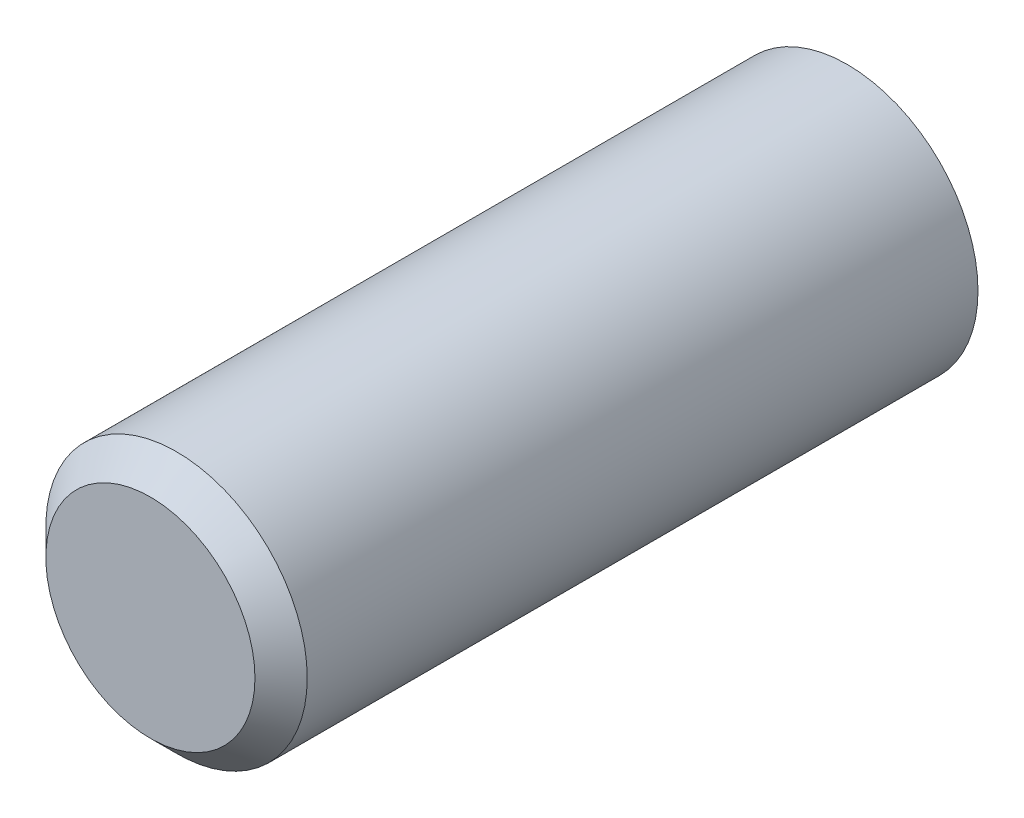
ISO-10303-21;
HEADER;
FILE_DESCRIPTION(('STEP AP214'),'2;1');
FILE_NAME('part.step','',(''),(''),'','','');
FILE_SCHEMA(('AUTOMOTIVE_DESIGN { 1 0 10303 214 1 1 1 1 }'));
ENDSEC;
DATA;
#1=APPLICATION_CONTEXT('core data for automotive mechanical design processes');
#2=APPLICATION_PROTOCOL_DEFINITION('international standard','automotive_design',2000,#1);
#3=PRODUCT_CONTEXT('',#1,'mechanical');
#4=PRODUCT('Part','Part','',(#3));
#5=PRODUCT_RELATED_PRODUCT_CATEGORY('part','',(#4));
#6=PRODUCT_DEFINITION_FORMATION('','',#4);
#7=PRODUCT_DEFINITION_CONTEXT('part definition',#1,'design');
#8=PRODUCT_DEFINITION('design','',#6,#7);
#9=PRODUCT_DEFINITION_SHAPE('','',#8);
#10=(LENGTH_UNIT() NAMED_UNIT(*) SI_UNIT(.MILLI.,.METRE.));
#11=(NAMED_UNIT(*) PLANE_ANGLE_UNIT() SI_UNIT($,.RADIAN.));
#12=(NAMED_UNIT(*) SI_UNIT($,.STERADIAN.) SOLID_ANGLE_UNIT());
#13=UNCERTAINTY_MEASURE_WITH_UNIT(LENGTH_MEASURE(1.E-05),#10,'distance_accuracy_value','');
#14=(GEOMETRIC_REPRESENTATION_CONTEXT(3) GLOBAL_UNCERTAINTY_ASSIGNED_CONTEXT((#13)) GLOBAL_UNIT_ASSIGNED_CONTEXT((#10,
#11,#12)) REPRESENTATION_CONTEXT('',''));
#15=CARTESIAN_POINT('',(0.,0.,0.));
#16=DIRECTION('',(0.,0.,1.));
#17=DIRECTION('',(1.,0.,0.));
#18=AXIS2_PLACEMENT_3D('',#15,#16,#17);
#19=CARTESIAN_POINT('',(0.,0.,10.));
#20=DIRECTION('',(0.,0.,1.));
#21=DIRECTION('',(-1.,0.,0.));
#22=AXIS2_PLACEMENT_3D('',#19,#20,#21);
#23=SPHERICAL_SURFACE('',#22,10.);
#24=CARTESIAN_POINT('',(0.,0.,1.3397459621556));
#25=DIRECTION('',(0.,0.,1.));
#26=DIRECTION('',(1.,0.,0.));
#27=AXIS2_PLACEMENT_3D('',#24,#25,#26);
#28=CIRCLE('',#27,5.);
#29=CARTESIAN_POINT('',(5.,0.,1.3397459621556));
#30=VERTEX_POINT('',#29);
#31=EDGE_CURVE('E8',#30,#30,#28,.T.);
#32=ORIENTED_EDGE('',*,*,#31,.F.);
#33=EDGE_LOOP('',(#32));
#34=FACE_BOUND('',#33,.T.);
#35=ADVANCED_FACE('F12',(#34),#23,.T.);
#36=CARTESIAN_POINT('',(0.,0.,28.));
#37=DIRECTION('',(0.,0.,1.));
#38=DIRECTION('',(1.,0.,0.));
#39=AXIS2_PLACEMENT_3D('',#36,#37,#38);
#40=CYLINDRICAL_SURFACE('',#39,5.);
#41=CARTESIAN_POINT('',(0.,0.,27.));
#42=DIRECTION('',(0.,0.,1.));
#43=DIRECTION('',(1.,0.,0.));
#44=AXIS2_PLACEMENT_3D('',#41,#42,#43);
#45=CIRCLE('',#44,5.);
#46=CARTESIAN_POINT('',(5.,0.,27.));
#47=VERTEX_POINT('',#46);
#48=EDGE_CURVE('E18',#47,#47,#45,.T.);
#49=ORIENTED_EDGE('',*,*,#48,.F.);
#50=EDGE_LOOP('',(#49));
#51=FACE_BOUND('',#50,.T.);
#52=ORIENTED_EDGE('',*,*,#31,.T.);
#53=EDGE_LOOP('',(#52));
#54=FACE_BOUND('',#53,.T.);
#55=ADVANCED_FACE('F33',(#51,#54),#40,.T.);
#56=CARTESIAN_POINT('',(0.,0.,27.));
#57=DIRECTION('',(0.,0.,-1.));
#58=DIRECTION('',(-1.,0.,0.));
#59=AXIS2_PLACEMENT_3D('',#56,#57,#58);
#60=CONICAL_SURFACE('',#59,5.,0.785398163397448);
#61=CARTESIAN_POINT('',(0.,0.,28.));
#62=DIRECTION('',(0.,0.,1.));
#63=DIRECTION('',(1.,0.,0.));
#64=AXIS2_PLACEMENT_3D('',#61,#62,#63);
#65=CIRCLE('',#64,4.);
#66=CARTESIAN_POINT('',(4.,0.,28.));
#67=VERTEX_POINT('',#66);
#68=EDGE_CURVE('E22',#67,#67,#65,.T.);
#69=ORIENTED_EDGE('',*,*,#68,.F.);
#70=EDGE_LOOP('',(#69));
#71=FACE_BOUND('',#70,.T.);
#72=ORIENTED_EDGE('',*,*,#48,.T.);
#73=EDGE_LOOP('',(#72));
#74=FACE_BOUND('',#73,.T.);
#75=ADVANCED_FACE('F31',(#71,#74),#60,.T.);
#76=CARTESIAN_POINT('',(0.,0.,28.));
#77=DIRECTION('',(0.,0.,-1.));
#78=DIRECTION('',(-1.,0.,0.));
#79=AXIS2_PLACEMENT_3D('',#76,#77,#78);
#80=PLANE('',#79);
#81=ORIENTED_EDGE('',*,*,#68,.T.);
#82=EDGE_LOOP('',(#81));
#83=FACE_BOUND('',#82,.T.);
#84=ADVANCED_FACE('F29',(#83),#80,.F.);
#85=CLOSED_SHELL('',(#35,#55,#75,#84));
#86=MANIFOLD_SOLID_BREP('B1',#85);
#87=ADVANCED_BREP_SHAPE_REPRESENTATION('',(#18,#86),#14);
#88=SHAPE_DEFINITION_REPRESENTATION(#9,#87);
ENDSEC;
END-ISO-10303-21;
